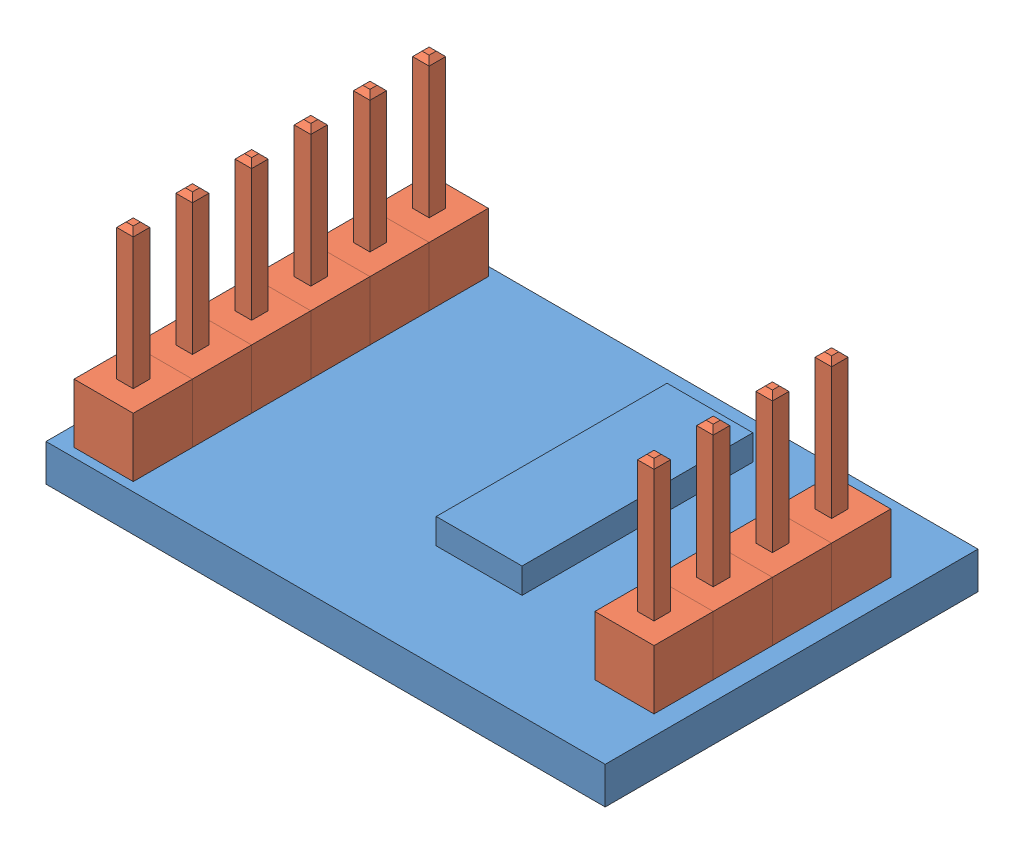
SolidWorks assembly Assem1.sldasm, configuration Default (file format 6000). Lengths in mm.
Overall size (29.74 10.16 29.91).
11 component instances, 2 part files, 30 mates.
Components (placement in the parent):
- hx711_Intfc_PCB-1: hx711_Intfc_PCB.SLDPRT [Default] at (-4.1777 0.0975 6.6661) size (29.74 2.68 29.91)
- 1 pin Header-1: 1 pin Header.SLDPRT [Default] at (-14.0837 10.067 0.3161) x (1 0 0) z (0 -1 0) size (2.54 2.54 10.16)
- 1 pin Header-2: 1 pin Header.SLDPRT [Default] at (-14.0837 10.067 2.8561) x (1 0 0) z (0 -1 0) size (2.54 2.54 10.16)
- 1 pin Header-3: 1 pin Header.SLDPRT [Default] at (-14.0837 10.067 5.3961) x (1 0 0) z (0 -1 0) size (2.54 2.54 10.16)
- 1 pin Header-4: 1 pin Header.SLDPRT [Default] at (-14.0837 10.067 7.9361) x (1 0 0) z (0 -1 0) size (2.54 2.54 10.16)
- 1 pin Header-5: 1 pin Header.SLDPRT [Default] at (-14.0837 10.067 10.4761) x (1 0 0) z (0 -1 0) size (2.54 2.54 10.16)
- 1 pin Header-6: 1 pin Header.SLDPRT [Default] at (-14.0837 10.067 13.0161) x (1 0 0) z (0 -1 0) size (2.54 2.54 10.16)
- 1 pin Header-7: 1 pin Header.SLDPRT [Default] at (5.7283 10.067 2.8561) x (1 0 0) z (0 -1 0) size (2.54 2.54 10.16)
- 1 pin Header-8: 1 pin Header.SLDPRT [Default] at (5.7283 10.067 5.3961) x (1 0 0) z (0 -1 0) size (2.54 2.54 10.16)
- 1 pin Header-9: 1 pin Header.SLDPRT [Default] at (5.7283 10.067 7.9361) x (1 0 0) z (0 -1 0) size (2.54 2.54 10.16)
- 1 pin Header-10: 1 pin Header.SLDPRT [Default] at (5.7283 10.067 10.4761) x (1 0 0) z (0 -1 0) size (2.54 2.54 10.16)
Mates (geometry in assembly coordinates):
- Concentric1: concentric anti-aligned: circle of hx711_Intfc_PCB-1; circle of 1 pin Header-1
- Coincident1: coincident anti-aligned: plane of hx711_Intfc_PCB-1 through (-4.1777 1.685 6.6661) normal (0 1 0); plane of 1 pin Header-1 through (-14.0837 1.685 0.3161) normal (0 -1 0)
- Parallel1: parallel aligned: plane of hx711_Intfc_PCB-1 through (-16.1777 1.685 14.6661) normal (-1 0 0); plane of 1 pin Header-1 through (-15.3537 1.685 -0.9539) normal (-1 0 0)
- Coincident2: coincident anti-aligned: plane of hx711_Intfc_PCB-1 through (-4.1777 1.685 6.6661) normal (0 1 0); plane of 1 pin Header-2 through (-14.0837 1.685 2.8561) normal (0 -1 0)
- Parallel2: parallel aligned: plane of hx711_Intfc_PCB-1 through (-16.1777 1.685 14.6661) normal (-1 0 0); plane of 1 pin Header-2 through (-15.3537 1.685 1.5861) normal (-1 0 0)
- Concentric2: concentric anti-aligned: circle of hx711_Intfc_PCB-1; circle of 1 pin Header-2
- Concentric3: concentric aligned: cylinder of hx711_Intfc_PCB-1 through (-14.0837 1.685 5.3961) axis (0 -1 0) radius 0.508; circle of 1 pin Header-3
- Coincident3: coincident anti-aligned: plane of hx711_Intfc_PCB-1 through (-4.1777 1.685 6.6661) normal (0 1 0); plane of 1 pin Header-3 through (-14.0837 1.685 5.3961) normal (0 -1 0)
- Parallel3: parallel aligned: plane of hx711_Intfc_PCB-1 through (-16.1777 1.685 14.6661) normal (-1 0 0); plane of 1 pin Header-3 through (-15.3537 1.685 4.1261) normal (-1 0 0)
- Concentric4: concentric anti-aligned: circle of hx711_Intfc_PCB-1; circle of 1 pin Header-4
- Coincident4: coincident anti-aligned: plane of hx711_Intfc_PCB-1 through (-4.1777 1.685 6.6661) normal (0 1 0); plane of 1 pin Header-4 through (-14.0837 1.685 7.9361) normal (0 -1 0)
- Parallel4: parallel aligned: plane of hx711_Intfc_PCB-1 through (-16.1777 1.685 14.6661) normal (-1 0 0); plane of 1 pin Header-4 through (-15.3537 1.685 6.6661) normal (-1 0 0)
- Concentric5: concentric anti-aligned: circle of hx711_Intfc_PCB-1; circle of 1 pin Header-5
- Coincident5: coincident anti-aligned: plane of hx711_Intfc_PCB-1 through (-4.1777 1.685 6.6661) normal (0 1 0); plane of 1 pin Header-5 through (-14.0837 1.685 10.4761) normal (0 -1 0)
- Parallel5: parallel aligned: plane of hx711_Intfc_PCB-1 through (-16.1777 1.685 14.6661) normal (-1 0 0); plane of 1 pin Header-5 through (-15.3537 1.685 9.2061) normal (-1 0 0)
- Concentric6: concentric anti-aligned: circle of hx711_Intfc_PCB-1; circle of 1 pin Header-6
- Coincident6: coincident anti-aligned: plane of hx711_Intfc_PCB-1 through (-4.1777 1.685 6.6661) normal (0 1 0); plane of 1 pin Header-6 through (-14.0837 1.685 13.0161) normal (0 -1 0)
- Parallel6: parallel aligned: plane of hx711_Intfc_PCB-1 through (-16.1777 1.685 14.6661) normal (-1 0 0); plane of 1 pin Header-6 through (-15.3537 1.685 11.7461) normal (-1 0 0)
- Concentric7: concentric aligned: cylinder of hx711_Intfc_PCB-1 through (5.7283 1.685 2.8561) axis (0 -1 0) radius 0.508; circle of 1 pin Header-7
- Coincident7: coincident anti-aligned: plane of hx711_Intfc_PCB-1 through (-4.1777 1.685 6.6661) normal (0 1 0); plane of 1 pin Header-7 through (5.7283 1.685 2.8561) normal (0 -1 0)
- Parallel7: parallel aligned: plane of hx711_Intfc_PCB-1 through (-16.1777 1.685 14.6661) normal (-1 0 0); plane of 1 pin Header-7 through (4.4583 1.685 1.5861) normal (-1 0 0)
- Concentric8: concentric anti-aligned: circle of hx711_Intfc_PCB-1; circle of 1 pin Header-8
- Coincident8: coincident anti-aligned: plane of hx711_Intfc_PCB-1 through (-4.1777 1.685 6.6661) normal (0 1 0); plane of 1 pin Header-8 through (5.7283 1.685 5.3961) normal (0 -1 0)
- Parallel8: parallel aligned: plane of hx711_Intfc_PCB-1 through (-16.1777 1.685 14.6661) normal (-1 0 0); plane of 1 pin Header-8 through (4.4583 1.685 4.1261) normal (-1 0 0)
- Concentric9: concentric anti-aligned: circle of hx711_Intfc_PCB-1; circle of 1 pin Header-9
- Coincident9: coincident anti-aligned: plane of hx711_Intfc_PCB-1 through (-4.1777 1.685 6.6661) normal (0 1 0); plane of 1 pin Header-9 through (5.7283 1.685 7.9361) normal (0 -1 0)
- Parallel9: parallel aligned: plane of hx711_Intfc_PCB-1 through (-16.1777 1.685 14.6661) normal (-1 0 0); plane of 1 pin Header-9 through (4.4583 1.685 6.6661) normal (-1 0 0)
- Concentric10: concentric anti-aligned: circle of hx711_Intfc_PCB-1; circle of 1 pin Header-10
- Coincident10: coincident anti-aligned: plane of hx711_Intfc_PCB-1 through (-4.1777 1.685 6.6661) normal (0 1 0); plane of 1 pin Header-10 through (5.7283 1.685 10.4761) normal (0 -1 0)
- Parallel10: parallel aligned: plane of hx711_Intfc_PCB-1 through (-16.1777 1.685 14.6661) normal (-1 0 0); plane of 1 pin Header-10 through (4.4583 1.685 9.2061) normal (-1 0 0)
